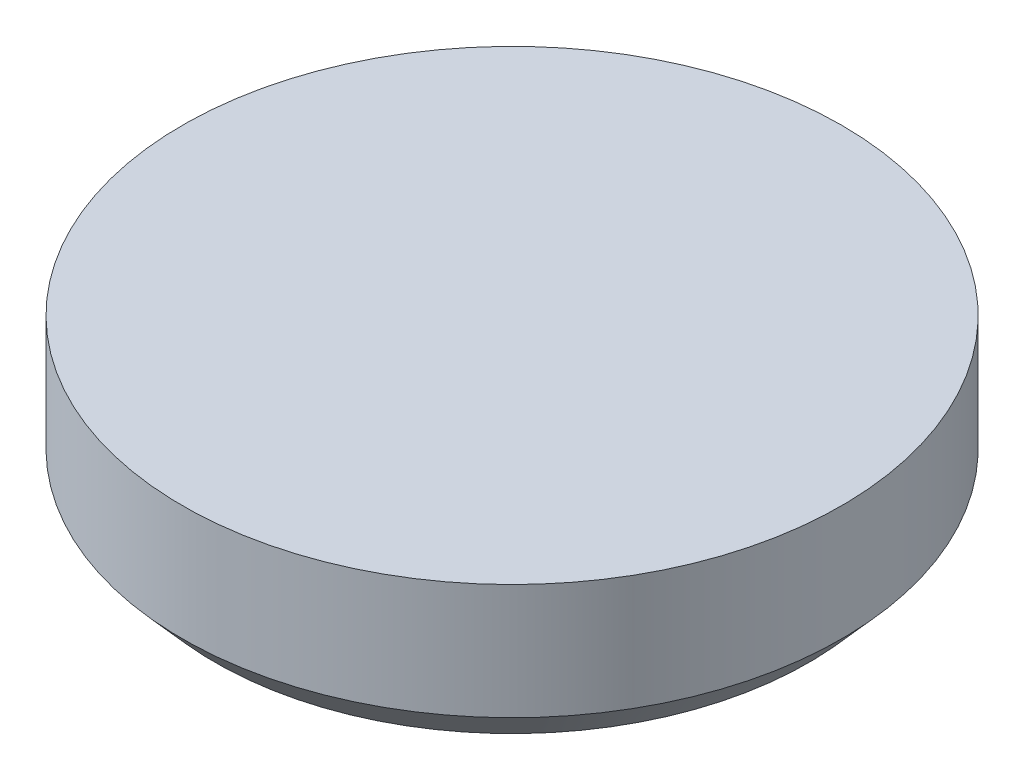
ISO-10303-21;
HEADER;
FILE_DESCRIPTION(('STEP AP214'),'2;1');
FILE_NAME('part.step','',(''),(''),'','','');
FILE_SCHEMA(('AUTOMOTIVE_DESIGN { 1 0 10303 214 1 1 1 1 }'));
ENDSEC;
DATA;
#1=APPLICATION_CONTEXT('core data for automotive mechanical design processes');
#2=APPLICATION_PROTOCOL_DEFINITION('international standard','automotive_design',2000,#1);
#3=PRODUCT_CONTEXT('',#1,'mechanical');
#4=PRODUCT('Part','Part','',(#3));
#5=PRODUCT_RELATED_PRODUCT_CATEGORY('part','',(#4));
#6=PRODUCT_DEFINITION_FORMATION('','',#4);
#7=PRODUCT_DEFINITION_CONTEXT('part definition',#1,'design');
#8=PRODUCT_DEFINITION('design','',#6,#7);
#9=PRODUCT_DEFINITION_SHAPE('','',#8);
#10=(LENGTH_UNIT() NAMED_UNIT(*) SI_UNIT(.MILLI.,.METRE.));
#11=(NAMED_UNIT(*) PLANE_ANGLE_UNIT() SI_UNIT($,.RADIAN.));
#12=(NAMED_UNIT(*) SI_UNIT($,.STERADIAN.) SOLID_ANGLE_UNIT());
#13=UNCERTAINTY_MEASURE_WITH_UNIT(LENGTH_MEASURE(1.E-05),#10,'distance_accuracy_value','');
#14=(GEOMETRIC_REPRESENTATION_CONTEXT(3) GLOBAL_UNCERTAINTY_ASSIGNED_CONTEXT((#13)) GLOBAL_UNIT_ASSIGNED_CONTEXT((#10,
#11,#12)) REPRESENTATION_CONTEXT('',''));
#15=CARTESIAN_POINT('',(0.,0.,0.));
#16=DIRECTION('',(0.,0.,1.));
#17=DIRECTION('',(1.,0.,0.));
#18=AXIS2_PLACEMENT_3D('',#15,#16,#17);
#19=CARTESIAN_POINT('',(0.,370.,0.));
#20=DIRECTION('',(0.,1.,0.));
#21=DIRECTION('',(0.,0.,1.));
#22=AXIS2_PLACEMENT_3D('',#19,#20,#21);
#23=PLANE('',#22);
#24=CARTESIAN_POINT('',(0.,370.,0.));
#25=DIRECTION('',(0.,-1.,0.));
#26=DIRECTION('',(0.,0.,-1.));
#27=AXIS2_PLACEMENT_3D('',#24,#25,#26);
#28=CIRCLE('',#27,800.);
#29=CARTESIAN_POINT('',(0.,370.,-800.));
#30=VERTEX_POINT('',#29);
#31=EDGE_CURVE('E10',#30,#30,#28,.T.);
#32=ORIENTED_EDGE('',*,*,#31,.F.);
#33=EDGE_LOOP('',(#32));
#34=FACE_BOUND('',#33,.T.);
#35=ADVANCED_FACE('F35',(#34),#23,.T.);
#36=CARTESIAN_POINT('',(0.,0.,0.));
#37=DIRECTION('',(0.,-1.,0.));
#38=DIRECTION('',(0.,0.,-1.));
#39=AXIS2_PLACEMENT_3D('',#36,#37,#38);
#40=CYLINDRICAL_SURFACE('',#39,800.);
#41=ORIENTED_EDGE('',*,*,#31,.T.);
#42=EDGE_LOOP('',(#41));
#43=FACE_BOUND('',#42,.T.);
#44=CARTESIAN_POINT('',(0.,90.,0.));
#45=DIRECTION('',(0.,-1.,0.));
#46=DIRECTION('',(0.,0.,-1.));
#47=AXIS2_PLACEMENT_3D('',#44,#45,#46);
#48=CIRCLE('',#47,800.);
#49=CARTESIAN_POINT('',(0.,90.,-800.));
#50=VERTEX_POINT('',#49);
#51=EDGE_CURVE('E41',#50,#50,#48,.T.);
#52=ORIENTED_EDGE('',*,*,#51,.F.);
#53=EDGE_LOOP('',(#52));
#54=FACE_BOUND('',#53,.T.);
#55=ADVANCED_FACE('F56',(#43,#54),#40,.T.);
#56=CARTESIAN_POINT('',(0.,0.,0.));
#57=DIRECTION('',(0.,1.,0.));
#58=DIRECTION('',(0.,0.,1.));
#59=AXIS2_PLACEMENT_3D('',#56,#57,#58);
#60=CONICAL_SURFACE('',#59,720.,0.726642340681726);
#61=ORIENTED_EDGE('',*,*,#51,.T.);
#62=EDGE_LOOP('',(#61));
#63=FACE_BOUND('',#62,.T.);
#64=CARTESIAN_POINT('',(0.,0.,0.));
#65=DIRECTION('',(0.,-1.,0.));
#66=DIRECTION('',(0.,0.,-1.));
#67=AXIS2_PLACEMENT_3D('',#64,#65,#66);
#68=CIRCLE('',#67,720.);
#69=CARTESIAN_POINT('',(0.,0.,-720.));
#70=VERTEX_POINT('',#69);
#71=EDGE_CURVE('E45',#70,#70,#68,.T.);
#72=ORIENTED_EDGE('',*,*,#71,.F.);
#73=EDGE_LOOP('',(#72));
#74=FACE_BOUND('',#73,.T.);
#75=ADVANCED_FACE('F54',(#63,#74),#60,.T.);
#76=CARTESIAN_POINT('',(720.,0.,0.));
#77=DIRECTION('',(0.,-1.,0.));
#78=DIRECTION('',(0.,0.,-1.));
#79=AXIS2_PLACEMENT_3D('',#76,#77,#78);
#80=PLANE('',#79);
#81=ORIENTED_EDGE('',*,*,#71,.T.);
#82=EDGE_LOOP('',(#81));
#83=FACE_BOUND('',#82,.T.);
#84=ADVANCED_FACE('F52',(#83),#80,.T.);
#85=CLOSED_SHELL('',(#35,#55,#75,#84));
#86=MANIFOLD_SOLID_BREP('B2',#85);
#87=ADVANCED_BREP_SHAPE_REPRESENTATION('',(#18,#86),#14);
#88=SHAPE_DEFINITION_REPRESENTATION(#9,#87);
ENDSEC;
END-ISO-10303-21;
